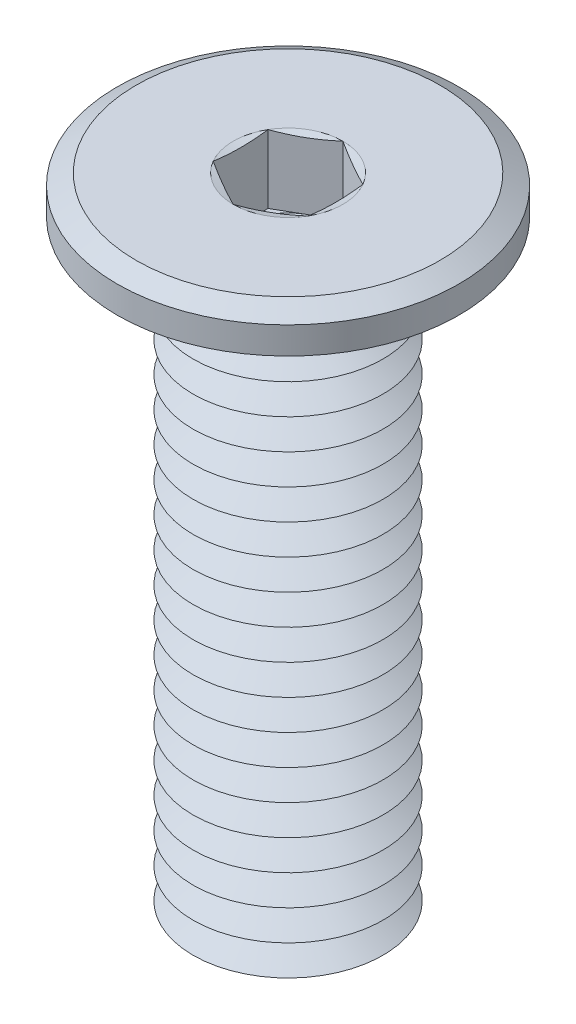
from build123d import *

# Parameters (mm, degrees)
SKETCH1_R           = 4.5
BOSS_EXTRUDE1_DEPTH = 1
SKETCH2_R           = 2.5
BOSS_EXTRUDE2_DEPTH = 16
LPATTERN1_COUNT     = 19
LPATTERN1_PITCH     = 0.8
FILLET1_R           = 0.2
CHAMFER2_SIZE       = 0.5
CHAMFER2_SIZE2      = 0.288675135
CUT_EXTRUDE1_DEPTH  = 1.8


with BuildPart() as part:
    # Sketch1 → Boss-Extrude1 (new body)
    with BuildSketch(Plane(origin=(0, 0, 0), x_dir=(1, 0, 0), z_dir=(0, 1, 0))):
        with Locations(Location((0, 0, 0), (0, 0, 270))):
            Circle(SKETCH1_R)
    extrude(amount=-BOSS_EXTRUDE1_DEPTH)

    # Sketch2 → Boss-Extrude2 (add)
    with BuildSketch(Plane.XZ.offset(1)):
        with Locations(Location((0, 0, 0), (0, 0, 270))):
            Circle(SKETCH2_R)
    extrude(amount=BOSS_EXTRUDE2_DEPTH)

    # Sketch5 → Cut-Revolve1 (revolve, cut)
    with BuildSketch(Plane(origin=(0, 0, 0), x_dir=(0, 0, -1), z_dir=(1, 0, 0))):
        Polygon((-2.5, -17.4), (-1.807179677, -17), (-2.5, -16.6), align=None)
    cut_revolve1 = revolve(axis=Axis((0, 0.990593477, 0), (0, -1, 0)), mode=Mode.SUBTRACT)

    # LPattern1: Cut-Revolve1 ×19
    with Locations(*[(0, i * LPATTERN1_PITCH, 0) for i in range(1, LPATTERN1_COUNT)]):
        add(cut_revolve1, mode=Mode.SUBTRACT)

    # Fillet1
    fillet1_edges = [part.edges().sort_by_distance(p)[0] for p in [
        (0, -1, 2.5),
    ]]
    fillet(fillet1_edges, radius=FILLET1_R)

    # Chamfer2
    chamfer2_edges = [part.edges().sort_by_distance(p)[0] for p in [
        (0, 0, -4.5),
    ]]
    chamfer2_side = [part.faces().sort_by_distance(p)[0] for p in [
        (0, 0, 0),
    ]]
    chamfer(chamfer2_edges, length=CHAMFER2_SIZE, length2=CHAMFER2_SIZE2, reference=chamfer2_side[0])

    # Sketch6 → Cut-Extrude1 (cut)
    with BuildSketch(Plane(origin=(0, 0, 0), x_dir=(1, 0, 0), z_dir=(0, 1, 0))):
        Polygon((0, 1.443375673), (-1.25, 0.721687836), (-1.25, -0.721687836), (0, -1.443375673), (1.25, -0.721687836), (1.25, 0.721687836), align=None)
    extrude(amount=-CUT_EXTRUDE1_DEPTH, mode=Mode.SUBTRACT)

    # Cut-Extrude2 cone 1 section (on through the dimple's axis) → Cut-Extrude2 (revolve, cut)
    with BuildSketch(Plane(origin=(0, -1.8, 0), x_dir=(0, 0, 1), z_dir=(1, 0, 0))):
        Polygon((0, 0), (1.25, 0), (0, 0.721687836), align=None)
    revolve(axis=Axis((0, -1.8, 0), (0, -1, 0)), mode=Mode.SUBTRACT)

    # Cut-Extrude3 cone 1 section (on through the dimple's axis) → Cut-Extrude3 (revolve, cut)
    with BuildSketch(Plane(origin=(0, 0, 0), x_dir=(0, 0, 1), z_dir=(1, 0, 0))):
        Polygon((0, 0), (1.443375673, 0), (0, 0.386751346), align=None)
    revolve(axis=Axis((0, 0, 0), (0, -1, 0)), mode=Mode.SUBTRACT)


solid = part.part
